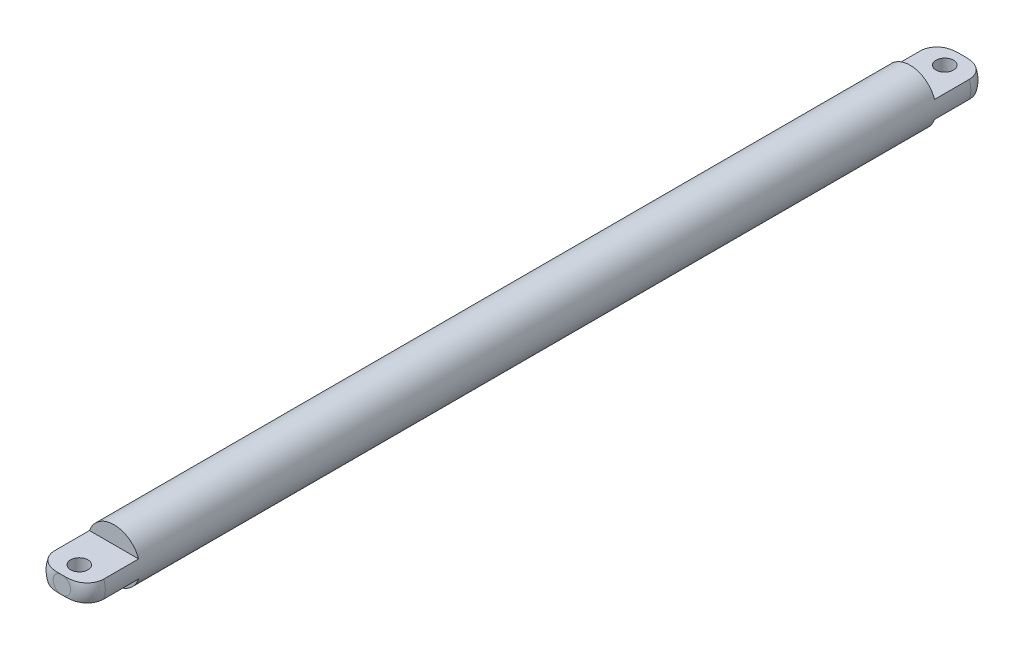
ISO-10303-21;
HEADER;
FILE_DESCRIPTION(('STEP AP214'),'2;1');
FILE_NAME('part.step','',(''),(''),'','','');
FILE_SCHEMA(('AUTOMOTIVE_DESIGN { 1 0 10303 214 1 1 1 1 }'));
ENDSEC;
DATA;
#1=APPLICATION_CONTEXT('core data for automotive mechanical design processes');
#2=APPLICATION_PROTOCOL_DEFINITION('international standard','automotive_design',2000,#1);
#3=PRODUCT_CONTEXT('',#1,'mechanical');
#4=PRODUCT('Part','Part','',(#3));
#5=PRODUCT_RELATED_PRODUCT_CATEGORY('part','',(#4));
#6=PRODUCT_DEFINITION_FORMATION('','',#4);
#7=PRODUCT_DEFINITION_CONTEXT('part definition',#1,'design');
#8=PRODUCT_DEFINITION('design','',#6,#7);
#9=PRODUCT_DEFINITION_SHAPE('','',#8);
#10=(LENGTH_UNIT() NAMED_UNIT(*) SI_UNIT(.MILLI.,.METRE.));
#11=(NAMED_UNIT(*) PLANE_ANGLE_UNIT() SI_UNIT($,.RADIAN.));
#12=(NAMED_UNIT(*) SI_UNIT($,.STERADIAN.) SOLID_ANGLE_UNIT());
#13=UNCERTAINTY_MEASURE_WITH_UNIT(LENGTH_MEASURE(1.E-05),#10,'distance_accuracy_value','');
#14=(GEOMETRIC_REPRESENTATION_CONTEXT(3) GLOBAL_UNCERTAINTY_ASSIGNED_CONTEXT((#13)) GLOBAL_UNIT_ASSIGNED_CONTEXT((#10,
#11,#12)) REPRESENTATION_CONTEXT('',''));
#15=CARTESIAN_POINT('',(0.,0.,0.));
#16=DIRECTION('',(0.,0.,1.));
#17=DIRECTION('',(1.,0.,0.));
#18=AXIS2_PLACEMENT_3D('',#15,#16,#17);
#19=CARTESIAN_POINT('',(0.,0.,-1036.));
#20=DIRECTION('',(0.,0.,1.));
#21=DIRECTION('',(1.,0.,0.));
#22=AXIS2_PLACEMENT_3D('',#19,#20,#21);
#23=CYLINDRICAL_SURFACE('',#22,30.);
#24=DIRECTION('',(0.,0.,1.));
#25=VECTOR('',#24,1.);
#26=CARTESIAN_POINT('',(-28.2842712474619,9.99999999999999,-1036.));
#27=LINE('',#26,#25);
#28=CARTESIAN_POINT('',(-28.2842712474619,9.99999999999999,-1016.));
#29=VERTEX_POINT('',#28);
#30=CARTESIAN_POINT('',(-28.2842712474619,9.99999999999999,-976.));
#31=VERTEX_POINT('',#30);
#32=EDGE_CURVE('E156',#29,#31,#27,.T.);
#33=ORIENTED_EDGE('',*,*,#32,.F.);
#34=CARTESIAN_POINT('',(0.,0.,-1016.));
#35=DIRECTION('',(0.,0.,1.));
#36=DIRECTION('',(1.,0.,0.));
#37=AXIS2_PLACEMENT_3D('',#34,#35,#36);
#38=CIRCLE('',#37,30.);
#39=CARTESIAN_POINT('',(-28.2842712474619,-9.99999999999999,-1016.));
#40=VERTEX_POINT('',#39);
#41=EDGE_CURVE('E284',#29,#40,#38,.T.);
#42=ORIENTED_EDGE('',*,*,#41,.T.);
#43=DIRECTION('',(0.,0.,1.));
#44=VECTOR('',#43,1.);
#45=CARTESIAN_POINT('',(-28.2842712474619,-9.99999999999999,-1036.));
#46=LINE('',#45,#44);
#47=CARTESIAN_POINT('',(-28.2842712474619,-9.99999999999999,-976.));
#48=VERTEX_POINT('',#47);
#49=EDGE_CURVE('E148',#40,#48,#46,.T.);
#50=ORIENTED_EDGE('',*,*,#49,.T.);
#51=CARTESIAN_POINT('',(0.,0.,-976.));
#52=DIRECTION('',(0.,0.,1.));
#53=DIRECTION('',(1.,0.,0.));
#54=AXIS2_PLACEMENT_3D('',#51,#52,#53);
#55=CIRCLE('',#54,30.);
#56=CARTESIAN_POINT('',(28.2842712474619,-9.99999999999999,-976.));
#57=VERTEX_POINT('',#56);
#58=EDGE_CURVE('E163',#57,#48,#55,.F.);
#59=ORIENTED_EDGE('',*,*,#58,.F.);
#60=DIRECTION('',(0.,0.,1.));
#61=VECTOR('',#60,1.);
#62=CARTESIAN_POINT('',(28.2842712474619,-9.99999999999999,-1036.));
#63=LINE('',#62,#61);
#64=CARTESIAN_POINT('',(28.2842712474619,-9.99999999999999,-1016.));
#65=VERTEX_POINT('',#64);
#66=EDGE_CURVE('E150',#57,#65,#63,.F.);
#67=ORIENTED_EDGE('',*,*,#66,.T.);
#68=CARTESIAN_POINT('',(0.,0.,-1016.));
#69=DIRECTION('',(0.,0.,1.));
#70=DIRECTION('',(1.,0.,0.));
#71=AXIS2_PLACEMENT_3D('',#68,#69,#70);
#72=CIRCLE('',#71,30.);
#73=CARTESIAN_POINT('',(28.2842712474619,9.99999999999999,-1016.));
#74=VERTEX_POINT('',#73);
#75=EDGE_CURVE('E223',#65,#74,#72,.T.);
#76=ORIENTED_EDGE('',*,*,#75,.T.);
#77=DIRECTION('',(0.,0.,1.));
#78=VECTOR('',#77,1.);
#79=CARTESIAN_POINT('',(28.2842712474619,9.99999999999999,-1036.));
#80=LINE('',#79,#78);
#81=CARTESIAN_POINT('',(28.2842712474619,9.99999999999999,-976.));
#82=VERTEX_POINT('',#81);
#83=EDGE_CURVE('E158',#82,#74,#80,.F.);
#84=ORIENTED_EDGE('',*,*,#83,.F.);
#85=CARTESIAN_POINT('',(0.,0.,-976.));
#86=DIRECTION('',(0.,0.,-1.));
#87=DIRECTION('',(-1.,0.,0.));
#88=AXIS2_PLACEMENT_3D('',#85,#86,#87);
#89=CIRCLE('',#88,30.);
#90=EDGE_CURVE('E160',#82,#31,#89,.F.);
#91=ORIENTED_EDGE('',*,*,#90,.T.);
#92=EDGE_LOOP('',(#33,#42,#50,#59,#67,#76,#84,#91));
#93=FACE_BOUND('',#92,.T.);
#94=DIRECTION('',(0.,0.,1.));
#95=VECTOR('',#94,1.);
#96=CARTESIAN_POINT('',(-28.284271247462,-9.99999999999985,-1036.));
#97=LINE('',#96,#95);
#98=CARTESIAN_POINT('',(-28.284271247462,-9.99999999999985,-20.));
#99=VERTEX_POINT('',#98);
#100=CARTESIAN_POINT('',(-28.284271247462,-9.99999999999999,-60.0000000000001));
#101=VERTEX_POINT('',#100);
#102=EDGE_CURVE('E128',#99,#101,#97,.F.);
#103=ORIENTED_EDGE('',*,*,#102,.F.);
#104=CARTESIAN_POINT('',(0.,0.,-20.));
#105=DIRECTION('',(0.,0.,1.));
#106=DIRECTION('',(1.,0.,0.));
#107=AXIS2_PLACEMENT_3D('',#104,#105,#106);
#108=CIRCLE('',#107,30.);
#109=CARTESIAN_POINT('',(-28.284271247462,9.99999999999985,-20.));
#110=VERTEX_POINT('',#109);
#111=EDGE_CURVE('E329',#99,#110,#108,.F.);
#112=ORIENTED_EDGE('',*,*,#111,.T.);
#113=DIRECTION('',(0.,0.,1.));
#114=VECTOR('',#113,1.);
#115=CARTESIAN_POINT('',(-28.284271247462,9.99999999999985,-1036.));
#116=LINE('',#115,#114);
#117=CARTESIAN_POINT('',(-28.2842712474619,9.99999999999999,-60.0000000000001));
#118=VERTEX_POINT('',#117);
#119=EDGE_CURVE('E143',#110,#118,#116,.F.);
#120=ORIENTED_EDGE('',*,*,#119,.T.);
#121=CARTESIAN_POINT('',(0.,0.,-60.0000000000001));
#122=DIRECTION('',(0.,0.,-1.));
#123=DIRECTION('',(-1.,0.,0.));
#124=AXIS2_PLACEMENT_3D('',#121,#122,#123);
#125=CIRCLE('',#124,30.);
#126=CARTESIAN_POINT('',(28.2842712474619,9.99999999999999,-60.0000000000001));
#127=VERTEX_POINT('',#126);
#128=EDGE_CURVE('E120',#127,#118,#125,.F.);
#129=ORIENTED_EDGE('',*,*,#128,.F.);
#130=DIRECTION('',(0.,0.,1.));
#131=VECTOR('',#130,1.);
#132=CARTESIAN_POINT('',(28.284271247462,9.99999999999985,-1036.));
#133=LINE('',#132,#131);
#134=CARTESIAN_POINT('',(28.284271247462,9.99999999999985,-20.));
#135=VERTEX_POINT('',#134);
#136=EDGE_CURVE('E141',#127,#135,#133,.T.);
#137=ORIENTED_EDGE('',*,*,#136,.T.);
#138=CARTESIAN_POINT('',(0.,0.,-20.));
#139=DIRECTION('',(0.,0.,1.));
#140=DIRECTION('',(1.,0.,0.));
#141=AXIS2_PLACEMENT_3D('',#138,#139,#140);
#142=CIRCLE('',#141,30.);
#143=CARTESIAN_POINT('',(28.284271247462,-9.99999999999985,-20.));
#144=VERTEX_POINT('',#143);
#145=EDGE_CURVE('E133',#135,#144,#142,.F.);
#146=ORIENTED_EDGE('',*,*,#145,.T.);
#147=DIRECTION('',(0.,0.,1.));
#148=VECTOR('',#147,1.);
#149=CARTESIAN_POINT('',(28.284271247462,-9.99999999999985,-1036.));
#150=LINE('',#149,#148);
#151=CARTESIAN_POINT('',(28.284271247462,-9.99999999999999,-60.0000000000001));
#152=VERTEX_POINT('',#151);
#153=EDGE_CURVE('E126',#152,#144,#150,.T.);
#154=ORIENTED_EDGE('',*,*,#153,.F.);
#155=CARTESIAN_POINT('',(0.,0.,-60.0000000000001));
#156=DIRECTION('',(0.,0.,1.));
#157=DIRECTION('',(1.,0.,0.));
#158=AXIS2_PLACEMENT_3D('',#155,#156,#157);
#159=CIRCLE('',#158,30.);
#160=EDGE_CURVE('E112',#152,#101,#159,.F.);
#161=ORIENTED_EDGE('',*,*,#160,.T.);
#162=EDGE_LOOP('',(#103,#112,#120,#129,#137,#146,#154,#161));
#163=FACE_BOUND('',#162,.T.);
#164=ADVANCED_FACE('F32',(#93,#163),#23,.T.);
#165=CARTESIAN_POINT('',(0.,0.,0.));
#166=DIRECTION('',(0.,0.,1.));
#167=DIRECTION('',(1.,0.,0.));
#168=AXIS2_PLACEMENT_3D('',#165,#166,#167);
#169=PLANE('',#168);
#170=CARTESIAN_POINT('',(0.,0.,0.));
#171=DIRECTION('',(0.,0.,1.));
#172=DIRECTION('',(1.,0.,0.));
#173=AXIS2_PLACEMENT_3D('',#170,#171,#172);
#174=CIRCLE('',#173,10.);
#175=CARTESIAN_POINT('',(0.,-9.99999999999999,0.));
#176=VERTEX_POINT('',#175);
#177=CARTESIAN_POINT('',(0.,9.99999999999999,0.));
#178=VERTEX_POINT('',#177);
#179=EDGE_CURVE('E119',#176,#178,#174,.T.);
#180=ORIENTED_EDGE('',*,*,#179,.T.);
#181=CARTESIAN_POINT('',(0.,0.,0.));
#182=DIRECTION('',(0.,0.,1.));
#183=DIRECTION('',(1.,0.,0.));
#184=AXIS2_PLACEMENT_3D('',#181,#182,#183);
#185=CIRCLE('',#184,10.);
#186=EDGE_CURVE('E170',#178,#176,#185,.T.);
#187=ORIENTED_EDGE('',*,*,#186,.T.);
#188=EDGE_LOOP('',(#180,#187));
#189=FACE_BOUND('',#188,.T.);
#190=ADVANCED_FACE('F234',(#189),#169,.T.);
#191=CARTESIAN_POINT('',(0.,0.,-1036.));
#192=DIRECTION('',(0.,0.,1.));
#193=DIRECTION('',(1.,0.,0.));
#194=AXIS2_PLACEMENT_3D('',#191,#192,#193);
#195=PLANE('',#194);
#196=CARTESIAN_POINT('',(0.,0.,-1036.));
#197=DIRECTION('',(0.,0.,1.));
#198=DIRECTION('',(1.,0.,0.));
#199=AXIS2_PLACEMENT_3D('',#196,#197,#198);
#200=CIRCLE('',#199,10.);
#201=CARTESIAN_POINT('',(0.,9.99999999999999,-1036.));
#202=VERTEX_POINT('',#201);
#203=CARTESIAN_POINT('',(0.,-9.99999999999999,-1036.));
#204=VERTEX_POINT('',#203);
#205=EDGE_CURVE('E56',#202,#204,#200,.F.);
#206=ORIENTED_EDGE('',*,*,#205,.T.);
#207=CARTESIAN_POINT('',(0.,0.,-1036.));
#208=DIRECTION('',(0.,0.,1.));
#209=DIRECTION('',(1.,0.,0.));
#210=AXIS2_PLACEMENT_3D('',#207,#208,#209);
#211=CIRCLE('',#210,10.);
#212=EDGE_CURVE('E256',#204,#202,#211,.F.);
#213=ORIENTED_EDGE('',*,*,#212,.T.);
#214=EDGE_LOOP('',(#206,#213));
#215=FACE_BOUND('',#214,.T.);
#216=ADVANCED_FACE('F238',(#215),#195,.F.);
#217=CARTESIAN_POINT('',(50.,0.,-976.));
#218=DIRECTION('',(0.,0.,-1.));
#219=DIRECTION('',(-1.,0.,0.));
#220=AXIS2_PLACEMENT_3D('',#217,#218,#219);
#221=PLANE('',#220);
#222=DIRECTION('',(-1.,0.,0.));
#223=VECTOR('',#222,1.);
#224=CARTESIAN_POINT('',(50.,9.99999999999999,-976.));
#225=LINE('',#224,#223);
#226=EDGE_CURVE('E153',#82,#31,#225,.T.);
#227=ORIENTED_EDGE('',*,*,#226,.T.);
#228=ORIENTED_EDGE('',*,*,#90,.F.);
#229=EDGE_LOOP('',(#227,#228));
#230=FACE_BOUND('',#229,.T.);
#231=ADVANCED_FACE('F242',(#230),#221,.T.);
#232=CARTESIAN_POINT('',(50.,9.99999999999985,0.));
#233=DIRECTION('',(0.,-1.,0.));
#234=DIRECTION('',(0.,0.,-1.));
#235=AXIS2_PLACEMENT_3D('',#232,#233,#234);
#236=PLANE('',#235);
#237=CARTESIAN_POINT('',(0.,9.99999999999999,-1016.));
#238=DIRECTION('',(0.,1.,0.));
#239=DIRECTION('',(0.,0.,1.));
#240=AXIS2_PLACEMENT_3D('',#237,#238,#239);
#241=CIRCLE('',#240,10.);
#242=CARTESIAN_POINT('',(0.,9.99999999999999,-1006.));
#243=VERTEX_POINT('',#242);
#244=EDGE_CURVE('E306',#243,#243,#241,.T.);
#245=ORIENTED_EDGE('',*,*,#244,.F.);
#246=EDGE_LOOP('',(#245));
#247=FACE_BOUND('',#246,.T.);
#248=CARTESIAN_POINT('',(28.2842712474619,9.99999999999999,-1016.));
#249=CARTESIAN_POINT('',(28.2842718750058,9.99999999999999,-1016.26700488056));
#250=CARTESIAN_POINT('',(28.2785993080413,9.99999999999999,-1016.53397957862));
#251=CARTESIAN_POINT('',(28.255926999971,9.99999999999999,-1017.06744081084));
#252=CARTESIAN_POINT('',(28.2389275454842,9.99999999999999,-1017.33392735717));
#253=CARTESIAN_POINT('',(28.170980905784,9.99999999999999,-1018.1318729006));
#254=CARTESIAN_POINT('',(28.1030854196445,9.99999999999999,-1018.66197937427));
#255=CARTESIAN_POINT('',(27.922800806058,9.99999999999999,-1019.71345979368));
#256=CARTESIAN_POINT('',(27.8105022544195,9.99999999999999,-1020.2348492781));
#257=CARTESIAN_POINT('',(27.6094183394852,9.99999999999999,-1021.00828780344));
#258=CARTESIAN_POINT('',(27.5369469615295,9.99999999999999,-1021.26467121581));
#259=CARTESIAN_POINT('',(27.3812452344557,9.99999999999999,-1021.77421994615));
#260=CARTESIAN_POINT('',(27.2980122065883,9.99999999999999,-1022.02738444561));
#261=CARTESIAN_POINT('',(27.0324150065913,9.99999999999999,-1022.78131952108));
#262=CARTESIAN_POINT('',(26.8341406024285,9.99999999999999,-1023.27657822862));
#263=CARTESIAN_POINT('',(26.39677415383,9.99999999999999,-1024.24873232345));
#264=CARTESIAN_POINT('',(26.1576814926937,9.99999999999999,-1024.72562743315));
#265=CARTESIAN_POINT('',(25.7698299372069,9.99999999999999,-1025.42484444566));
#266=CARTESIAN_POINT('',(25.6356085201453,9.99999999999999,-1025.65533197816));
#267=CARTESIAN_POINT('',(25.3577298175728,9.99999999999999,-1026.11046479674));
#268=CARTESIAN_POINT('',(25.2140750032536,9.99999999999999,-1026.33511159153));
#269=CARTESIAN_POINT('',(24.7692972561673,10.,-1026.99985346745));
#270=CARTESIAN_POINT('',(24.4543383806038,9.99999999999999,-1027.43079081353));
#271=CARTESIAN_POINT('',(23.7865680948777,9.99999999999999,-1028.2697000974));
#272=CARTESIAN_POINT('',(23.4333931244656,9.99999999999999,-1028.67738253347));
#273=CARTESIAN_POINT('',(22.879510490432,9.99999999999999,-1029.2660061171));
#274=CARTESIAN_POINT('',(22.6908508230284,9.99999999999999,-1029.4584082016));
#275=CARTESIAN_POINT('',(22.305787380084,9.99999999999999,-1029.83538650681));
#276=CARTESIAN_POINT('',(22.1093819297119,9.99999999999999,-1030.01996101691));
#277=CARTESIAN_POINT('',(21.5099321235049,9.99999999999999,-1030.56079562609));
#278=CARTESIAN_POINT('',(21.0958874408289,9.99999999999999,-1030.90498059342));
#279=CARTESIAN_POINT('',(20.2416834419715,9.99999999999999,-1031.55925830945));
#280=CARTESIAN_POINT('',(19.8015225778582,9.99999999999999,-1031.86934903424));
#281=CARTESIAN_POINT('',(19.1159837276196,9.99999999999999,-1032.31330456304));
#282=CARTESIAN_POINT('',(18.8788956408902,9.99999999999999,-1032.46011400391));
#283=CARTESIAN_POINT('',(18.3991048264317,9.99999999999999,-1032.74411107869));
#284=CARTESIAN_POINT('',(18.1564034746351,9.99999999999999,-1032.88130103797));
#285=CARTESIAN_POINT('',(17.4203319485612,9.99999999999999,-1033.27844129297));
#286=CARTESIAN_POINT('',(16.9190630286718,9.99999999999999,-1033.52391757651));
#287=CARTESIAN_POINT('',(15.8965773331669,9.99999999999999,-1033.97727199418));
#288=CARTESIAN_POINT('',(15.3752650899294,9.99999999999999,-1034.18493334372));
#289=CARTESIAN_POINT('',(14.3192543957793,9.99999999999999,-1034.56156386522));
#290=CARTESIAN_POINT('',(13.7845645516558,9.99999999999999,-1034.73055723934));
#291=CARTESIAN_POINT('',(12.7054710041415,9.99999999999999,-1035.03140671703));
#292=CARTESIAN_POINT('',(12.1610772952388,9.99999999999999,-1035.16329892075));
#293=CARTESIAN_POINT('',(11.0650204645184,9.99999999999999,-1035.39273021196));
#294=CARTESIAN_POINT('',(10.513355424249,9.99999999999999,-1035.49026003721));
#295=CARTESIAN_POINT('',(9.40347530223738,9.99999999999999,-1035.65486449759));
#296=CARTESIAN_POINT('',(8.84524343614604,9.99999999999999,-1035.72182381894));
#297=CARTESIAN_POINT('',(7.72638292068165,9.99999999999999,-1035.82963879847));
#298=CARTESIAN_POINT('',(7.16575440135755,9.99999999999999,-1035.87049585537));
#299=CARTESIAN_POINT('',(6.05248255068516,9.99999999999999,-1035.93167085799));
#300=CARTESIAN_POINT('',(5.49985548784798,9.99999999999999,-1035.9523079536));
#301=CARTESIAN_POINT('',(4.39425645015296,9.99999999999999,-1035.98073095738));
#302=CARTESIAN_POINT('',(3.84128444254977,9.99999999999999,-1035.98851536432));
#303=CARTESIAN_POINT('',(3.01422520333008,9.99999999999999,-1035.99531483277));
#304=CARTESIAN_POINT('',(2.74014831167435,9.99999999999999,-1035.9967726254));
#305=CARTESIAN_POINT('',(2.19199042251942,9.99999999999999,-1035.99873949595));
#306=CARTESIAN_POINT('',(1.9179094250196,9.99999999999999,-1035.99924857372));
#307=CARTESIAN_POINT('',(1.36985607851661,9.99999999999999,-1035.99985070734));
#308=CARTESIAN_POINT('',(1.09588372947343,9.99999999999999,-1035.99994392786));
#309=CARTESIAN_POINT('',(0.547940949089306,9.99999999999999,-1035.99999921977));
#310=CARTESIAN_POINT('',(0.273970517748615,9.99999999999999,-1035.99996129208));
#311=CARTESIAN_POINT('',(0.,9.99999999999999,-1036.));
#312=B_SPLINE_CURVE_WITH_KNOTS('',3,(#248,#249,#250,#251,#252,#253,#254,#255,#256,#257,#258,
#259,#260,#261,#262,#263,#264,#265,#266,#267,#268,#269,#270,#271,#272,#273,#274,#275,#276,#277,
#278,#279,#280,#281,#282,#283,#284,#285,#286,#287,#288,#289,#290,#291,#292,#293,#294,#295,#296,
#297,#298,#299,#300,#301,#302,#303,#304,#305,#306,#307,#308,#309,#310,#311),.UNSPECIFIED.,.F.,
.F.,(4,2,2,2,2,2,2,2,2,2,2,2,2,2,2,2,2,2,2,2,2,2,2,2,2,2,2,2,2,2,2,4),(0.,0.800894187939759,
1.60176811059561,3.20303283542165,4.80104792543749,5.6001285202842,6.39940840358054,
7.99782432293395,9.59626439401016,10.3962242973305,11.1959754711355,12.7953383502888,
14.4115371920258,15.2197340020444,16.0281065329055,17.6415071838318,19.2550035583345,
20.091390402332,20.9275743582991,22.6001870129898,24.2821056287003,25.9629686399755,
27.6421904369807,29.3218645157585,31.0078231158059,32.6936913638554,34.3524994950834,
36.0115013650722,36.8337441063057,37.6559869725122,38.4779041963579,39.2998155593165),.UNSPECIFIED.);
#313=EDGE_CURVE('E45',#74,#202,#312,.T.);
#314=ORIENTED_EDGE('',*,*,#313,.T.);
#315=CARTESIAN_POINT('',(0.,10.,-1036.));
#316=CARTESIAN_POINT('',(-0.206523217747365,10.,-1035.99998728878));
#317=CARTESIAN_POINT('',(-0.413046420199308,9.99999999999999,-1035.99999970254));
#318=CARTESIAN_POINT('',(-0.826093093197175,9.99999999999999,-1035.99998191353));
#319=CARTESIAN_POINT('',(-1.03261656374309,9.99999999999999,-1035.9999517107));
#320=CARTESIAN_POINT('',(-1.44568058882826,9.99999999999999,-1035.99975581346));
#321=CARTESIAN_POINT('',(-1.65222114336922,9.99999999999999,-1035.99959010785));
#322=CARTESIAN_POINT('',(-2.06530166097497,9.99999999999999,-1035.99894297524));
#323=CARTESIAN_POINT('',(-2.27184162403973,9.99999999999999,-1035.99846154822));
#324=CARTESIAN_POINT('',(-2.89267803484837,9.99999999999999,-1035.99620721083));
#325=CARTESIAN_POINT('',(-3.30697304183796,9.99999999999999,-1035.99362232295));
#326=CARTESIAN_POINT('',(-4.13551254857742,9.99999999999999,-1035.98393030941));
#327=CARTESIAN_POINT('',(-4.54975704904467,9.99999999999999,-1035.97682325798));
#328=CARTESIAN_POINT('',(-5.38526440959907,9.99999999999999,-1035.95515898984));
#329=CARTESIAN_POINT('',(-5.80652426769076,9.99999999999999,-1035.9404745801));
#330=CARTESIAN_POINT('',(-6.64857761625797,9.99999999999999,-1035.90068432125));
#331=CARTESIAN_POINT('',(-7.0693711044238,9.99999999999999,-1035.87557842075));
#332=CARTESIAN_POINT('',(-7.90952797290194,9.99999999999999,-1035.81228355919));
#333=CARTESIAN_POINT('',(-8.32889242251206,9.99999999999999,-1035.77410916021));
#334=CARTESIAN_POINT('',(-9.16593893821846,9.99999999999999,-1035.68231395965));
#335=CARTESIAN_POINT('',(-9.58362109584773,9.99999999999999,-1035.6286940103));
#336=CARTESIAN_POINT('',(-10.3268090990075,9.99999999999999,-1035.51744730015));
#337=CARTESIAN_POINT('',(-10.6528153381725,9.99999999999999,-1035.4631637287));
#338=CARTESIAN_POINT('',(-11.3027204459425,9.99999999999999,-1035.3430795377));
#339=CARTESIAN_POINT('',(-11.6266192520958,9.99999999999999,-1035.27727857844));
#340=CARTESIAN_POINT('',(-12.2717961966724,9.99999999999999,-1035.1334858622));
#341=CARTESIAN_POINT('',(-12.5930736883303,9.99999999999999,-1035.05549118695));
#342=CARTESIAN_POINT('',(-13.2322837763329,9.99999999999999,-1034.88681207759));
#343=CARTESIAN_POINT('',(-13.5502161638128,9.99999999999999,-1034.7961268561));
#344=CARTESIAN_POINT('',(-14.4942643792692,9.99999999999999,-1034.50553818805));
#345=CARTESIAN_POINT('',(-15.1145672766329,9.99999999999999,-1034.28623812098));
#346=CARTESIAN_POINT('',(-16.3334669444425,9.99999999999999,-1033.79396988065));
#347=CARTESIAN_POINT('',(-16.9320651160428,9.99999999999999,-1033.52100517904));
#348=CARTESIAN_POINT('',(-18.1081383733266,9.99999999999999,-1032.91781286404));
#349=CARTESIAN_POINT('',(-18.6853083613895,9.99999999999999,-1032.58698791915));
#350=CARTESIAN_POINT('',(-19.8052239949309,9.99999999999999,-1031.87127867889));
#351=CARTESIAN_POINT('',(-20.34796707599,9.99999999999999,-1031.48639036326));
#352=CARTESIAN_POINT('',(-21.3938129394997,9.99999999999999,-1030.66416848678));
#353=CARTESIAN_POINT('',(-21.896841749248,9.99999999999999,-1030.22674071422));
#354=CARTESIAN_POINT('',(-22.8562444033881,9.99999999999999,-1029.30345424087));
#355=CARTESIAN_POINT('',(-23.3126258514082,9.99999999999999,-1028.81760345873));
#356=CARTESIAN_POINT('',(-24.1124740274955,9.99999999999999,-1027.87369870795));
#357=CARTESIAN_POINT('',(-24.4627828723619,9.99999999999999,-1027.42142259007));
#358=CARTESIAN_POINT('',(-25.1219463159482,9.99999999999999,-1026.48763218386));
#359=CARTESIAN_POINT('',(-25.4308052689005,9.99999999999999,-1026.00612097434));
#360=CARTESIAN_POINT('',(-26.0039954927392,9.99999999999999,-1025.01800227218));
#361=CARTESIAN_POINT('',(-26.2683758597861,9.99999999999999,-1024.51142326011));
#362=CARTESIAN_POINT('',(-26.7506464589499,9.99999999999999,-1023.47659184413));
#363=CARTESIAN_POINT('',(-26.9685375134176,9.99999999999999,-1022.94833982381));
#364=CARTESIAN_POINT('',(-27.3469233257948,9.99999999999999,-1021.89912206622));
#365=CARTESIAN_POINT('',(-27.5096003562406,9.99999999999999,-1021.37894237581));
#366=CARTESIAN_POINT('',(-27.7895071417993,9.99999999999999,-1020.32653113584));
#367=CARTESIAN_POINT('',(-27.9067390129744,9.99999999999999,-1019.79430014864));
#368=CARTESIAN_POINT('',(-28.0949972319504,9.99999999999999,-1018.72044788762));
#369=CARTESIAN_POINT('',(-28.1659216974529,9.99999999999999,-1018.17880858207));
#370=CARTESIAN_POINT('',(-28.2369016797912,9.99999999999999,-1017.36337534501));
#371=CARTESIAN_POINT('',(-28.2546605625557,9.99999999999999,-1017.09101671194));
#372=CARTESIAN_POINT('',(-28.278345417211,9.99999999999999,-1016.54578375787));
#373=CARTESIAN_POINT('',(-28.2842713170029,9.99999999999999,-1016.27290943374));
#374=CARTESIAN_POINT('',(-28.2842712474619,9.99999999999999,-1016.));
#375=B_SPLINE_CURVE_WITH_KNOTS('',3,(#315,#316,#317,#318,#319,#320,#321,#322,#323,#324,#325,
#326,#327,#328,#329,#330,#331,#332,#333,#334,#335,#336,#337,#338,#339,#340,#341,#342,#343,#344,
#345,#346,#347,#348,#349,#350,#351,#352,#353,#354,#355,#356,#357,#358,#359,#360,#361,#362,#363,
#364,#365,#366,#367,#368,#369,#370,#371,#372,#373,#374),.UNSPECIFIED.,.F.,.F.,(4,2,2,2,2,2,2,2,
2,2,2,2,2,2,2,2,2,2,2,2,2,2,2,2,2,2,2,2,2,4),(0.,0.619569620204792,1.23914005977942,
1.85876168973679,2.47838335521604,3.72128055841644,4.96415736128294,6.22861050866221,
7.49306989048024,8.75612486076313,10.0191101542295,11.0104069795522,12.0017330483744,
12.9932967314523,13.9849219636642,15.9561191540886,17.92718886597,19.9199583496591,
21.9128760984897,23.9094223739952,25.9056426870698,27.6197023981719,29.3335819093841,
31.0455570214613,32.7575018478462,34.3905550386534,36.0235321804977,37.6600900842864,
38.4786790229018,39.2972729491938),.UNSPECIFIED.);
#376=EDGE_CURVE('E11',#202,#29,#375,.T.);
#377=ORIENTED_EDGE('',*,*,#376,.T.);
#378=ORIENTED_EDGE('',*,*,#32,.T.);
#379=ORIENTED_EDGE('',*,*,#226,.F.);
#380=ORIENTED_EDGE('',*,*,#83,.T.);
#381=EDGE_LOOP('',(#314,#377,#378,#379,#380));
#382=FACE_BOUND('',#381,.T.);
#383=ADVANCED_FACE('F244',(#247,#382),#236,.F.);
#384=CARTESIAN_POINT('',(50.,-9.99999999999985,0.));
#385=DIRECTION('',(0.,-1.,0.));
#386=DIRECTION('',(0.,0.,-1.));
#387=AXIS2_PLACEMENT_3D('',#384,#385,#386);
#388=PLANE('',#387);
#389=CARTESIAN_POINT('',(0.,-9.99999999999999,-1016.));
#390=DIRECTION('',(0.,-1.,0.));
#391=DIRECTION('',(0.,0.,-1.));
#392=AXIS2_PLACEMENT_3D('',#389,#390,#391);
#393=CIRCLE('',#392,10.);
#394=CARTESIAN_POINT('',(0.,-9.99999999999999,-1026.));
#395=VERTEX_POINT('',#394);
#396=EDGE_CURVE('E304',#395,#395,#393,.F.);
#397=ORIENTED_EDGE('',*,*,#396,.T.);
#398=EDGE_LOOP('',(#397));
#399=FACE_BOUND('',#398,.T.);
#400=ORIENTED_EDGE('',*,*,#49,.F.);
#401=CARTESIAN_POINT('',(-28.2842712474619,-9.99999999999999,-1016.));
#402=CARTESIAN_POINT('',(-28.2842718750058,-9.99999999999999,-1016.26700488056));
#403=CARTESIAN_POINT('',(-28.2785993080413,-9.99999999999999,-1016.53397957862));
#404=CARTESIAN_POINT('',(-28.255926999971,-9.99999999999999,-1017.06744081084));
#405=CARTESIAN_POINT('',(-28.2389275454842,-9.99999999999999,-1017.33392735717));
#406=CARTESIAN_POINT('',(-28.170980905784,-9.99999999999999,-1018.1318729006));
#407=CARTESIAN_POINT('',(-28.1030854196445,-9.99999999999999,-1018.66197937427));
#408=CARTESIAN_POINT('',(-27.922800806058,-9.99999999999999,-1019.71345979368));
#409=CARTESIAN_POINT('',(-27.8105022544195,-9.99999999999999,-1020.2348492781));
#410=CARTESIAN_POINT('',(-27.6094183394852,-9.99999999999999,-1021.00828780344));
#411=CARTESIAN_POINT('',(-27.5369469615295,-9.99999999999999,-1021.26467121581));
#412=CARTESIAN_POINT('',(-27.3812452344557,-9.99999999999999,-1021.77421994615));
#413=CARTESIAN_POINT('',(-27.2980122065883,-9.99999999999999,-1022.02738444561));
#414=CARTESIAN_POINT('',(-27.0324150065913,-9.99999999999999,-1022.78131952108));
#415=CARTESIAN_POINT('',(-26.8341406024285,-9.99999999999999,-1023.27657822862));
#416=CARTESIAN_POINT('',(-26.39677415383,-9.99999999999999,-1024.24873232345));
#417=CARTESIAN_POINT('',(-26.1576814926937,-9.99999999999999,-1024.72562743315));
#418=CARTESIAN_POINT('',(-25.7698299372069,-9.99999999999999,-1025.42484444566));
#419=CARTESIAN_POINT('',(-25.6356085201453,-9.99999999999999,-1025.65533197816));
#420=CARTESIAN_POINT('',(-25.3577298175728,-9.99999999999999,-1026.11046479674));
#421=CARTESIAN_POINT('',(-25.2140750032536,-9.99999999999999,-1026.33511159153));
#422=CARTESIAN_POINT('',(-24.7692972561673,-10.,-1026.99985346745));
#423=CARTESIAN_POINT('',(-24.4543383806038,-9.99999999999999,-1027.43079081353));
#424=CARTESIAN_POINT('',(-23.7865680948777,-9.99999999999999,-1028.2697000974));
#425=CARTESIAN_POINT('',(-23.4333931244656,-9.99999999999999,-1028.67738253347));
#426=CARTESIAN_POINT('',(-22.879510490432,-9.99999999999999,-1029.2660061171));
#427=CARTESIAN_POINT('',(-22.6908508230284,-9.99999999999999,-1029.4584082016));
#428=CARTESIAN_POINT('',(-22.305787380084,-9.99999999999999,-1029.83538650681));
#429=CARTESIAN_POINT('',(-22.1093819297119,-9.99999999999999,-1030.01996101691));
#430=CARTESIAN_POINT('',(-21.5099321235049,-9.99999999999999,-1030.56079562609));
#431=CARTESIAN_POINT('',(-21.0958874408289,-9.99999999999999,-1030.90498059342));
#432=CARTESIAN_POINT('',(-20.2416834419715,-9.99999999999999,-1031.55925830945));
#433=CARTESIAN_POINT('',(-19.8015225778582,-9.99999999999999,-1031.86934903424));
#434=CARTESIAN_POINT('',(-19.1159837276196,-9.99999999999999,-1032.31330456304));
#435=CARTESIAN_POINT('',(-18.8788956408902,-9.99999999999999,-1032.46011400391));
#436=CARTESIAN_POINT('',(-18.3991048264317,-9.99999999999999,-1032.74411107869));
#437=CARTESIAN_POINT('',(-18.1564034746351,-9.99999999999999,-1032.88130103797));
#438=CARTESIAN_POINT('',(-17.4203319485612,-9.99999999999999,-1033.27844129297));
#439=CARTESIAN_POINT('',(-16.9190630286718,-9.99999999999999,-1033.52391757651));
#440=CARTESIAN_POINT('',(-15.8965773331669,-9.99999999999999,-1033.97727199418));
#441=CARTESIAN_POINT('',(-15.3752650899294,-9.99999999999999,-1034.18493334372));
#442=CARTESIAN_POINT('',(-14.3192543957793,-9.99999999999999,-1034.56156386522));
#443=CARTESIAN_POINT('',(-13.7845645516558,-9.99999999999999,-1034.73055723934));
#444=CARTESIAN_POINT('',(-12.7054710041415,-9.99999999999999,-1035.03140671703));
#445=CARTESIAN_POINT('',(-12.1610772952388,-9.99999999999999,-1035.16329892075));
#446=CARTESIAN_POINT('',(-11.0650204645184,-9.99999999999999,-1035.39273021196));
#447=CARTESIAN_POINT('',(-10.513355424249,-9.99999999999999,-1035.49026003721));
#448=CARTESIAN_POINT('',(-9.40347530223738,-9.99999999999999,-1035.65486449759));
#449=CARTESIAN_POINT('',(-8.84524343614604,-9.99999999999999,-1035.72182381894));
#450=CARTESIAN_POINT('',(-7.72638292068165,-9.99999999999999,-1035.82963879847));
#451=CARTESIAN_POINT('',(-7.16575440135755,-9.99999999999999,-1035.87049585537));
#452=CARTESIAN_POINT('',(-6.05248255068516,-9.99999999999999,-1035.93167085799));
#453=CARTESIAN_POINT('',(-5.49985548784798,-9.99999999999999,-1035.9523079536));
#454=CARTESIAN_POINT('',(-4.39425645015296,-9.99999999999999,-1035.98073095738));
#455=CARTESIAN_POINT('',(-3.84128444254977,-9.99999999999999,-1035.98851536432));
#456=CARTESIAN_POINT('',(-3.01422520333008,-9.99999999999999,-1035.99531483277));
#457=CARTESIAN_POINT('',(-2.74014831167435,-9.99999999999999,-1035.9967726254));
#458=CARTESIAN_POINT('',(-2.19199042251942,-9.99999999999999,-1035.99873949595));
#459=CARTESIAN_POINT('',(-1.9179094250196,-9.99999999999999,-1035.99924857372));
#460=CARTESIAN_POINT('',(-1.36985607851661,-9.99999999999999,-1035.99985070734));
#461=CARTESIAN_POINT('',(-1.09588372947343,-9.99999999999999,-1035.99994392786));
#462=CARTESIAN_POINT('',(-0.547940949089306,-9.99999999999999,-1035.99999921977));
#463=CARTESIAN_POINT('',(-0.273970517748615,-9.99999999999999,-1035.99996129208));
#464=CARTESIAN_POINT('',(0.,-9.99999999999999,-1036.));
#465=B_SPLINE_CURVE_WITH_KNOTS('',3,(#401,#402,#403,#404,#405,#406,#407,#408,#409,#410,#411,
#412,#413,#414,#415,#416,#417,#418,#419,#420,#421,#422,#423,#424,#425,#426,#427,#428,#429,#430,
#431,#432,#433,#434,#435,#436,#437,#438,#439,#440,#441,#442,#443,#444,#445,#446,#447,#448,#449,
#450,#451,#452,#453,#454,#455,#456,#457,#458,#459,#460,#461,#462,#463,#464),.UNSPECIFIED.,.F.,
.F.,(4,2,2,2,2,2,2,2,2,2,2,2,2,2,2,2,2,2,2,2,2,2,2,2,2,2,2,2,2,2,2,4),(0.,0.800894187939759,
1.60176811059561,3.20303283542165,4.80104792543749,5.6001285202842,6.39940840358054,
7.99782432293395,9.59626439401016,10.3962242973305,11.1959754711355,12.7953383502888,
14.4115371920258,15.2197340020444,16.0281065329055,17.6415071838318,19.2550035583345,
20.091390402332,20.9275743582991,22.6001870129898,24.2821056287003,25.9629686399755,
27.6421904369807,29.3218645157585,31.0078231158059,32.6936913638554,34.3524994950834,
36.0115013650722,36.8337441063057,37.6559869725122,38.4779041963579,39.2998155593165),.UNSPECIFIED.);
#466=EDGE_CURVE('E259',#40,#204,#465,.T.);
#467=ORIENTED_EDGE('',*,*,#466,.T.);
#468=CARTESIAN_POINT('',(0.,-10.,-1036.));
#469=CARTESIAN_POINT('',(0.206523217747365,-10.,-1035.99998728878));
#470=CARTESIAN_POINT('',(0.413046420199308,-9.99999999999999,-1035.99999970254));
#471=CARTESIAN_POINT('',(0.826093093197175,-9.99999999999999,-1035.99998191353));
#472=CARTESIAN_POINT('',(1.03261656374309,-9.99999999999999,-1035.9999517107));
#473=CARTESIAN_POINT('',(1.44568058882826,-9.99999999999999,-1035.99975581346));
#474=CARTESIAN_POINT('',(1.65222114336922,-9.99999999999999,-1035.99959010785));
#475=CARTESIAN_POINT('',(2.06530166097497,-9.99999999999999,-1035.99894297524));
#476=CARTESIAN_POINT('',(2.27184162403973,-9.99999999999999,-1035.99846154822));
#477=CARTESIAN_POINT('',(2.89267803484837,-9.99999999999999,-1035.99620721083));
#478=CARTESIAN_POINT('',(3.30697304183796,-9.99999999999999,-1035.99362232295));
#479=CARTESIAN_POINT('',(4.13551254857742,-9.99999999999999,-1035.98393030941));
#480=CARTESIAN_POINT('',(4.54975704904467,-9.99999999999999,-1035.97682325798));
#481=CARTESIAN_POINT('',(5.38526440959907,-9.99999999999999,-1035.95515898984));
#482=CARTESIAN_POINT('',(5.80652426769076,-9.99999999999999,-1035.9404745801));
#483=CARTESIAN_POINT('',(6.64857761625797,-9.99999999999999,-1035.90068432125));
#484=CARTESIAN_POINT('',(7.0693711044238,-9.99999999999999,-1035.87557842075));
#485=CARTESIAN_POINT('',(7.90952797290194,-9.99999999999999,-1035.81228355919));
#486=CARTESIAN_POINT('',(8.32889242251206,-9.99999999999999,-1035.77410916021));
#487=CARTESIAN_POINT('',(9.16593893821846,-9.99999999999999,-1035.68231395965));
#488=CARTESIAN_POINT('',(9.58362109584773,-9.99999999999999,-1035.6286940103));
#489=CARTESIAN_POINT('',(10.3268090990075,-9.99999999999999,-1035.51744730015));
#490=CARTESIAN_POINT('',(10.6528153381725,-9.99999999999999,-1035.4631637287));
#491=CARTESIAN_POINT('',(11.3027204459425,-9.99999999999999,-1035.3430795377));
#492=CARTESIAN_POINT('',(11.6266192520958,-9.99999999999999,-1035.27727857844));
#493=CARTESIAN_POINT('',(12.2717961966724,-9.99999999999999,-1035.1334858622));
#494=CARTESIAN_POINT('',(12.5930736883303,-9.99999999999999,-1035.05549118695));
#495=CARTESIAN_POINT('',(13.2322837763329,-9.99999999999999,-1034.88681207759));
#496=CARTESIAN_POINT('',(13.5502161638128,-9.99999999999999,-1034.7961268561));
#497=CARTESIAN_POINT('',(14.4942643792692,-9.99999999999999,-1034.50553818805));
#498=CARTESIAN_POINT('',(15.1145672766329,-9.99999999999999,-1034.28623812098));
#499=CARTESIAN_POINT('',(16.3334669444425,-9.99999999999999,-1033.79396988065));
#500=CARTESIAN_POINT('',(16.9320651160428,-9.99999999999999,-1033.52100517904));
#501=CARTESIAN_POINT('',(18.1081383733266,-9.99999999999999,-1032.91781286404));
#502=CARTESIAN_POINT('',(18.6853083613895,-9.99999999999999,-1032.58698791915));
#503=CARTESIAN_POINT('',(19.8052239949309,-9.99999999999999,-1031.87127867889));
#504=CARTESIAN_POINT('',(20.34796707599,-9.99999999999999,-1031.48639036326));
#505=CARTESIAN_POINT('',(21.3938129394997,-9.99999999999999,-1030.66416848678));
#506=CARTESIAN_POINT('',(21.896841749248,-9.99999999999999,-1030.22674071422));
#507=CARTESIAN_POINT('',(22.8562444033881,-9.99999999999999,-1029.30345424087));
#508=CARTESIAN_POINT('',(23.3126258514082,-9.99999999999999,-1028.81760345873));
#509=CARTESIAN_POINT('',(24.1124740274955,-9.99999999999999,-1027.87369870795));
#510=CARTESIAN_POINT('',(24.4627828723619,-9.99999999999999,-1027.42142259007));
#511=CARTESIAN_POINT('',(25.1219463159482,-9.99999999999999,-1026.48763218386));
#512=CARTESIAN_POINT('',(25.4308052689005,-9.99999999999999,-1026.00612097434));
#513=CARTESIAN_POINT('',(26.0039954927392,-9.99999999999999,-1025.01800227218));
#514=CARTESIAN_POINT('',(26.2683758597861,-9.99999999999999,-1024.51142326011));
#515=CARTESIAN_POINT('',(26.7506464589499,-9.99999999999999,-1023.47659184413));
#516=CARTESIAN_POINT('',(26.9685375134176,-9.99999999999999,-1022.94833982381));
#517=CARTESIAN_POINT('',(27.3469233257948,-9.99999999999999,-1021.89912206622));
#518=CARTESIAN_POINT('',(27.5096003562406,-9.99999999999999,-1021.37894237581));
#519=CARTESIAN_POINT('',(27.7895071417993,-9.99999999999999,-1020.32653113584));
#520=CARTESIAN_POINT('',(27.9067390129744,-9.99999999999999,-1019.79430014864));
#521=CARTESIAN_POINT('',(28.0949972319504,-9.99999999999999,-1018.72044788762));
#522=CARTESIAN_POINT('',(28.1659216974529,-9.99999999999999,-1018.17880858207));
#523=CARTESIAN_POINT('',(28.2369016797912,-9.99999999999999,-1017.36337534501));
#524=CARTESIAN_POINT('',(28.2546605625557,-9.99999999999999,-1017.09101671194));
#525=CARTESIAN_POINT('',(28.278345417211,-9.99999999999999,-1016.54578375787));
#526=CARTESIAN_POINT('',(28.2842713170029,-9.99999999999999,-1016.27290943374));
#527=CARTESIAN_POINT('',(28.2842712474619,-9.99999999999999,-1016.));
#528=B_SPLINE_CURVE_WITH_KNOTS('',3,(#468,#469,#470,#471,#472,#473,#474,#475,#476,#477,#478,
#479,#480,#481,#482,#483,#484,#485,#486,#487,#488,#489,#490,#491,#492,#493,#494,#495,#496,#497,
#498,#499,#500,#501,#502,#503,#504,#505,#506,#507,#508,#509,#510,#511,#512,#513,#514,#515,#516,
#517,#518,#519,#520,#521,#522,#523,#524,#525,#526,#527),.UNSPECIFIED.,.F.,.F.,(4,2,2,2,2,2,2,2,
2,2,2,2,2,2,2,2,2,2,2,2,2,2,2,2,2,2,2,2,2,4),(0.,0.619569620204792,1.23914005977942,
1.85876168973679,2.47838335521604,3.72128055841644,4.96415736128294,6.22861050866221,
7.49306989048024,8.75612486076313,10.0191101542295,11.0104069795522,12.0017330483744,
12.9932967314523,13.9849219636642,15.9561191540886,17.92718886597,19.9199583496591,
21.9128760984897,23.9094223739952,25.9056426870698,27.6197023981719,29.3335819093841,
31.0455570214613,32.7575018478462,34.3905550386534,36.0235321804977,37.6600900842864,
38.4786790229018,39.2972729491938),.UNSPECIFIED.);
#529=EDGE_CURVE('E264',#204,#65,#528,.T.);
#530=ORIENTED_EDGE('',*,*,#529,.T.);
#531=ORIENTED_EDGE('',*,*,#66,.F.);
#532=DIRECTION('',(-1.,0.,0.));
#533=VECTOR('',#532,1.);
#534=CARTESIAN_POINT('',(50.,-9.99999999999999,-976.));
#535=LINE('',#534,#533);
#536=EDGE_CURVE('E145',#57,#48,#535,.T.);
#537=ORIENTED_EDGE('',*,*,#536,.T.);
#538=EDGE_LOOP('',(#400,#467,#530,#531,#537));
#539=FACE_BOUND('',#538,.T.);
#540=ADVANCED_FACE('F248',(#399,#539),#388,.T.);
#541=CARTESIAN_POINT('',(50.,0.,-976.));
#542=DIRECTION('',(0.,0.,1.));
#543=DIRECTION('',(1.,0.,0.));
#544=AXIS2_PLACEMENT_3D('',#541,#542,#543);
#545=PLANE('',#544);
#546=ORIENTED_EDGE('',*,*,#536,.F.);
#547=ORIENTED_EDGE('',*,*,#58,.T.);
#548=EDGE_LOOP('',(#546,#547));
#549=FACE_BOUND('',#548,.T.);
#550=ADVANCED_FACE('F206',(#549),#545,.F.);
#551=CARTESIAN_POINT('',(50.,9.99999999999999,0.));
#552=DIRECTION('',(0.,1.,0.));
#553=DIRECTION('',(0.,0.,1.));
#554=AXIS2_PLACEMENT_3D('',#551,#552,#553);
#555=PLANE('',#554);
#556=CARTESIAN_POINT('',(0.,9.99999999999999,-20.));
#557=DIRECTION('',(0.,1.,0.));
#558=DIRECTION('',(0.,0.,1.));
#559=AXIS2_PLACEMENT_3D('',#556,#557,#558);
#560=CIRCLE('',#559,10.);
#561=CARTESIAN_POINT('',(0.,9.99999999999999,-10.));
#562=VERTEX_POINT('',#561);
#563=EDGE_CURVE('E309',#562,#562,#560,.T.);
#564=ORIENTED_EDGE('',*,*,#563,.F.);
#565=EDGE_LOOP('',(#564));
#566=FACE_BOUND('',#565,.T.);
#567=ORIENTED_EDGE('',*,*,#119,.F.);
#568=CARTESIAN_POINT('',(-28.284271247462,9.99999999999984,-20.));
#569=CARTESIAN_POINT('',(-28.2842718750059,9.99999999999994,-19.7329951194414));
#570=CARTESIAN_POINT('',(-28.2785993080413,9.99999999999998,-19.4660204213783));
#571=CARTESIAN_POINT('',(-28.255926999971,10.,-18.9325591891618));
#572=CARTESIAN_POINT('',(-28.2389275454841,10.,-18.6660726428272));
#573=CARTESIAN_POINT('',(-28.170980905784,9.99999999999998,-17.8681270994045));
#574=CARTESIAN_POINT('',(-28.1030854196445,9.99999999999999,-17.3380206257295));
#575=CARTESIAN_POINT('',(-27.922800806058,10.,-16.286540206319));
#576=CARTESIAN_POINT('',(-27.8105022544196,9.99999999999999,-15.7651507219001));
#577=CARTESIAN_POINT('',(-27.6094183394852,9.99999999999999,-14.9917121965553));
#578=CARTESIAN_POINT('',(-27.5369469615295,9.99999999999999,-14.7353287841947));
#579=CARTESIAN_POINT('',(-27.3812452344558,9.99999999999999,-14.225780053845));
#580=CARTESIAN_POINT('',(-27.2980122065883,9.99999999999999,-13.9726155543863));
#581=CARTESIAN_POINT('',(-27.0324150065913,9.99999999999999,-13.2186804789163));
#582=CARTESIAN_POINT('',(-26.8341406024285,9.99999999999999,-12.7234217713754));
#583=CARTESIAN_POINT('',(-26.3967741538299,9.99999999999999,-11.7512676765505));
#584=CARTESIAN_POINT('',(-26.1576814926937,9.99999999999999,-11.2743725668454));
#585=CARTESIAN_POINT('',(-25.7698299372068,9.99999999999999,-10.5751555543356));
#586=CARTESIAN_POINT('',(-25.6356085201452,9.99999999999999,-10.3446680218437));
#587=CARTESIAN_POINT('',(-25.3577298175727,9.99999999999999,-9.8895352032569));
#588=CARTESIAN_POINT('',(-25.2140750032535,9.99999999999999,-9.66488840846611));
#589=CARTESIAN_POINT('',(-24.7692972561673,9.99999999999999,-9.00014653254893));
#590=CARTESIAN_POINT('',(-24.4543383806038,9.99999999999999,-8.56920918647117));
#591=CARTESIAN_POINT('',(-23.7865680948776,9.99999999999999,-7.73029990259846));
#592=CARTESIAN_POINT('',(-23.4333931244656,9.99999999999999,-7.32261746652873));
#593=CARTESIAN_POINT('',(-22.879510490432,9.99999999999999,-6.73399388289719));
#594=CARTESIAN_POINT('',(-22.6908508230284,9.99999999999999,-6.5415917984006));
#595=CARTESIAN_POINT('',(-22.305787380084,9.99999999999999,-6.16461349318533));
#596=CARTESIAN_POINT('',(-22.1093819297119,9.99999999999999,-5.98003898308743));
#597=CARTESIAN_POINT('',(-21.5099321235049,10.,-5.43920437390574));
#598=CARTESIAN_POINT('',(-21.0958874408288,9.99999999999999,-5.0950194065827));
#599=CARTESIAN_POINT('',(-20.2416834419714,9.99999999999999,-4.44074169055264));
#600=CARTESIAN_POINT('',(-19.801522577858,9.99999999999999,-4.13065096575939));
#601=CARTESIAN_POINT('',(-19.1159837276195,9.99999999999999,-3.68669543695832));
#602=CARTESIAN_POINT('',(-18.8788956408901,9.99999999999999,-3.53988599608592));
#603=CARTESIAN_POINT('',(-18.3991048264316,9.99999999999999,-3.25588892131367));
#604=CARTESIAN_POINT('',(-18.156403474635,9.99999999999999,-3.1186989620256));
#605=CARTESIAN_POINT('',(-17.420331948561,9.99999999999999,-2.72155870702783));
#606=CARTESIAN_POINT('',(-16.9190630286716,9.99999999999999,-2.47608242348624));
#607=CARTESIAN_POINT('',(-15.8965773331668,9.99999999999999,-2.02272800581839));
#608=CARTESIAN_POINT('',(-15.3752650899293,9.99999999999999,-1.81506665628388));
#609=CARTESIAN_POINT('',(-14.3192543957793,9.99999999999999,-1.43843613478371));
#610=CARTESIAN_POINT('',(-13.7845645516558,9.99999999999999,-1.26944276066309));
#611=CARTESIAN_POINT('',(-12.7054710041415,9.99999999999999,-0.968593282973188));
#612=CARTESIAN_POINT('',(-12.1610772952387,9.99999999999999,-0.836701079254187));
#613=CARTESIAN_POINT('',(-11.0650204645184,9.99999999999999,-0.607269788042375));
#614=CARTESIAN_POINT('',(-10.513355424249,9.99999999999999,-0.509739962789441));
#615=CARTESIAN_POINT('',(-9.40347530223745,9.99999999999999,-0.345135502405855));
#616=CARTESIAN_POINT('',(-8.84524343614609,9.99999999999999,-0.278176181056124));
#617=CARTESIAN_POINT('',(-7.72638292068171,9.99999999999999,-0.170361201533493));
#618=CARTESIAN_POINT('',(-7.16575440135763,9.99999999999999,-0.12950414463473));
#619=CARTESIAN_POINT('',(-6.05248255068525,9.99999999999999,-0.0683291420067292));
#620=CARTESIAN_POINT('',(-5.49985548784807,9.99999999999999,-0.0476920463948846));
#621=CARTESIAN_POINT('',(-4.39425645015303,9.99999999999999,-0.0192690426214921));
#622=CARTESIAN_POINT('',(-3.84128444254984,9.99999999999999,-0.0114846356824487));
#623=CARTESIAN_POINT('',(-3.01422520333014,9.99999999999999,-0.00468516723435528));
#624=CARTESIAN_POINT('',(-2.74014831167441,9.99999999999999,-0.00322737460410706));
#625=CARTESIAN_POINT('',(-2.19199042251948,9.99999999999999,-0.00126050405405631));
#626=CARTESIAN_POINT('',(-1.91790942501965,9.99999999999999,-0.000751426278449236));
#627=CARTESIAN_POINT('',(-1.36985607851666,9.99999999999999,-0.000149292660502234));
#628=CARTESIAN_POINT('',(-1.09588372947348,9.99999999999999,-5.60721360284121E-05));
#629=CARTESIAN_POINT('',(-0.547940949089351,9.99999999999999,-7.80231473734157E-07));
#630=CARTESIAN_POINT('',(-0.273970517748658,9.99999999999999,-3.87079162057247E-05));
#631=CARTESIAN_POINT('',(0.,9.99999999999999,0.));
#632=B_SPLINE_CURVE_WITH_KNOTS('',3,(#568,#569,#570,#571,#572,#573,#574,#575,#576,#577,#578,
#579,#580,#581,#582,#583,#584,#585,#586,#587,#588,#589,#590,#591,#592,#593,#594,#595,#596,#597,
#598,#599,#600,#601,#602,#603,#604,#605,#606,#607,#608,#609,#610,#611,#612,#613,#614,#615,#616,
#617,#618,#619,#620,#621,#622,#623,#624,#625,#626,#627,#628,#629,#630,#631),.UNSPECIFIED.,.F.,
.F.,(4,2,2,2,2,2,2,2,2,2,2,2,2,2,2,2,2,2,2,2,2,2,2,2,2,2,2,2,2,2,2,4),(0.,0.800894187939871,
1.60176811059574,3.20303283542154,4.80104792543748,5.60012852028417,6.39940840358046,
7.99782432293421,9.59626439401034,10.3962242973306,11.1959754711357,12.7953383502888,
14.4115371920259,15.2197340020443,16.0281065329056,17.6415071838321,19.2550035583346,
20.0913904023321,20.9275743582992,22.6001870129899,24.2821056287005,25.9629686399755,
27.6421904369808,29.3218645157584,31.0078231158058,32.6936913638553,34.3524994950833,
36.0115013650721,36.8337441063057,37.6559869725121,38.4779041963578,39.2998155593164),.UNSPECIFIED.);
#633=EDGE_CURVE('E217',#110,#178,#632,.T.);
#634=ORIENTED_EDGE('',*,*,#633,.T.);
#635=CARTESIAN_POINT('',(0.,10.,0.));
#636=CARTESIAN_POINT('',(0.206523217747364,10.,-1.27112249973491E-05));
#637=CARTESIAN_POINT('',(0.413046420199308,9.99999999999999,-2.97463429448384E-07));
#638=CARTESIAN_POINT('',(0.826093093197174,9.99999999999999,-1.80864722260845E-05));
#639=CARTESIAN_POINT('',(1.03261656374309,9.99999999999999,-4.8289298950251E-05));
#640=CARTESIAN_POINT('',(1.44568058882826,9.99999999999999,-0.000244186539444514));
#641=CARTESIAN_POINT('',(1.65222114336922,9.99999999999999,-0.000409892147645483));
#642=CARTESIAN_POINT('',(2.06530166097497,9.99999999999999,-0.0010570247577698));
#643=CARTESIAN_POINT('',(2.27184162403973,9.99999999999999,-0.00153845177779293));
#644=CARTESIAN_POINT('',(2.89267803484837,9.99999999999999,-0.00379278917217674));
#645=CARTESIAN_POINT('',(3.30697304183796,9.99999999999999,-0.00637767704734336));
#646=CARTESIAN_POINT('',(4.13551254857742,9.99999999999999,-0.0160696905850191));
#647=CARTESIAN_POINT('',(4.54975704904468,9.99999999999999,-0.023176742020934));
#648=CARTESIAN_POINT('',(5.38526440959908,9.99999999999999,-0.0448410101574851));
#649=CARTESIAN_POINT('',(5.80652426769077,9.99999999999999,-0.0595254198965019));
#650=CARTESIAN_POINT('',(6.64857761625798,9.99999999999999,-0.099315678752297));
#651=CARTESIAN_POINT('',(7.06937110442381,9.99999999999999,-0.124421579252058));
#652=CARTESIAN_POINT('',(7.90952797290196,9.99999999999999,-0.187716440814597));
#653=CARTESIAN_POINT('',(8.32889242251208,9.99999999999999,-0.225890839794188));
#654=CARTESIAN_POINT('',(9.16593893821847,9.99999999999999,-0.317686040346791));
#655=CARTESIAN_POINT('',(9.58362109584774,9.99999999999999,-0.371305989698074));
#656=CARTESIAN_POINT('',(10.3268090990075,9.99999999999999,-0.482552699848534));
#657=CARTESIAN_POINT('',(10.6528153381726,9.99999999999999,-0.536836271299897));
#658=CARTESIAN_POINT('',(11.3027204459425,9.99999999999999,-0.656920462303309));
#659=CARTESIAN_POINT('',(11.6266192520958,9.99999999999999,-0.722721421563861));
#660=CARTESIAN_POINT('',(12.2717961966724,9.99999999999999,-0.866514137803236));
#661=CARTESIAN_POINT('',(12.5930736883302,9.99999999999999,-0.944508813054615));
#662=CARTESIAN_POINT('',(13.2322837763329,9.99999999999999,-1.11318792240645));
#663=CARTESIAN_POINT('',(13.5502161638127,9.99999999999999,-1.20387314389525));
#664=CARTESIAN_POINT('',(14.4942643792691,9.99999999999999,-1.49446181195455));
#665=CARTESIAN_POINT('',(15.1145672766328,9.99999999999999,-1.71376187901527));
#666=CARTESIAN_POINT('',(16.3334669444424,9.99999999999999,-2.20603011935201));
#667=CARTESIAN_POINT('',(16.9320651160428,9.99999999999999,-2.47899482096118));
#668=CARTESIAN_POINT('',(18.1081383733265,9.99999999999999,-3.08218713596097));
#669=CARTESIAN_POINT('',(18.6853083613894,9.99999999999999,-3.41301208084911));
#670=CARTESIAN_POINT('',(19.8052239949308,9.99999999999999,-4.12872132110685));
#671=CARTESIAN_POINT('',(20.3479670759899,9.99999999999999,-4.51360963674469));
#672=CARTESIAN_POINT('',(21.3938129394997,9.99999999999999,-5.33583151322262));
#673=CARTESIAN_POINT('',(21.896841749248,9.99999999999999,-5.77325928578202));
#674=CARTESIAN_POINT('',(22.856244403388,9.99999999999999,-6.69654575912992));
#675=CARTESIAN_POINT('',(23.3126258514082,9.99999999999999,-7.18239654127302));
#676=CARTESIAN_POINT('',(24.1124740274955,9.99999999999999,-8.1263012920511));
#677=CARTESIAN_POINT('',(24.4627828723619,9.99999999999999,-8.57857740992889));
#678=CARTESIAN_POINT('',(25.1219463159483,9.99999999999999,-9.5123678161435));
#679=CARTESIAN_POINT('',(25.4308052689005,9.99999999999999,-9.99387902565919));
#680=CARTESIAN_POINT('',(26.0039954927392,9.99999999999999,-10.981997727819));
#681=CARTESIAN_POINT('',(26.2683758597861,9.99999999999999,-11.4885767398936));
#682=CARTESIAN_POINT('',(26.7506464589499,9.99999999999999,-12.5234081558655));
#683=CARTESIAN_POINT('',(26.9685375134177,9.99999999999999,-13.0516601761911));
#684=CARTESIAN_POINT('',(27.3469233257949,9.99999999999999,-14.1008779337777));
#685=CARTESIAN_POINT('',(27.5096003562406,9.99999999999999,-14.621057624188));
#686=CARTESIAN_POINT('',(27.7895071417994,9.99999999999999,-15.6734688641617));
#687=CARTESIAN_POINT('',(27.9067390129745,9.99999999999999,-16.2056998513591));
#688=CARTESIAN_POINT('',(28.0949972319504,9.99999999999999,-17.2795521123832));
#689=CARTESIAN_POINT('',(28.1659216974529,9.99999999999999,-17.8211914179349));
#690=CARTESIAN_POINT('',(28.2369016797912,9.99999999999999,-18.636624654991));
#691=CARTESIAN_POINT('',(28.2546605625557,9.99999999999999,-18.908983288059));
#692=CARTESIAN_POINT('',(28.278345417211,9.99999999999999,-19.4542162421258));
#693=CARTESIAN_POINT('',(28.2842713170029,9.99999999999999,-19.7270905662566));
#694=CARTESIAN_POINT('',(28.2842712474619,9.99999999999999,-20.));
#695=B_SPLINE_CURVE_WITH_KNOTS('',3,(#635,#636,#637,#638,#639,#640,#641,#642,#643,#644,#645,
#646,#647,#648,#649,#650,#651,#652,#653,#654,#655,#656,#657,#658,#659,#660,#661,#662,#663,#664,
#665,#666,#667,#668,#669,#670,#671,#672,#673,#674,#675,#676,#677,#678,#679,#680,#681,#682,#683,
#684,#685,#686,#687,#688,#689,#690,#691,#692,#693,#694),.UNSPECIFIED.,.F.,.F.,(4,2,2,2,2,2,2,2,
2,2,2,2,2,2,2,2,2,2,2,2,2,2,2,2,2,2,2,2,2,4),(0.,0.619569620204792,1.23914005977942,
1.85876168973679,2.47838335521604,3.72128055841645,4.96415736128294,6.22861050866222,
7.49306989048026,8.75612486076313,10.0191101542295,11.0104069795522,12.0017330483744,
12.9932967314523,13.9849219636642,15.9561191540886,17.92718886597,19.9199583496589,
21.9128760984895,23.9094223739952,25.9056426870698,27.619702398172,29.3335819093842,
31.0455570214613,32.7575018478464,34.3905550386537,36.0235321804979,37.6600900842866,
38.478679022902,39.297272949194),.UNSPECIFIED.);
#696=EDGE_CURVE('E211',#178,#135,#695,.T.);
#697=ORIENTED_EDGE('',*,*,#696,.T.);
#698=ORIENTED_EDGE('',*,*,#136,.F.);
#699=DIRECTION('',(-1.,0.,0.));
#700=VECTOR('',#699,1.);
#701=CARTESIAN_POINT('',(50.,9.99999999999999,-60.0000000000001));
#702=LINE('',#701,#700);
#703=EDGE_CURVE('E135',#127,#118,#702,.T.);
#704=ORIENTED_EDGE('',*,*,#703,.T.);
#705=EDGE_LOOP('',(#567,#634,#697,#698,#704));
#706=FACE_BOUND('',#705,.T.);
#707=ADVANCED_FACE('F201',(#566,#706),#555,.T.);
#708=CARTESIAN_POINT('',(50.,0.,-60.0000000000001));
#709=DIRECTION('',(0.,0.,-1.));
#710=DIRECTION('',(-1.,0.,0.));
#711=AXIS2_PLACEMENT_3D('',#708,#709,#710);
#712=PLANE('',#711);
#713=ORIENTED_EDGE('',*,*,#703,.F.);
#714=ORIENTED_EDGE('',*,*,#128,.T.);
#715=EDGE_LOOP('',(#713,#714));
#716=FACE_BOUND('',#715,.T.);
#717=ADVANCED_FACE('F198',(#716),#712,.F.);
#718=CARTESIAN_POINT('',(50.,0.,-60.0000000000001));
#719=DIRECTION('',(0.,0.,1.));
#720=DIRECTION('',(1.,0.,0.));
#721=AXIS2_PLACEMENT_3D('',#718,#719,#720);
#722=PLANE('',#721);
#723=DIRECTION('',(-1.,0.,0.));
#724=VECTOR('',#723,1.);
#725=CARTESIAN_POINT('',(50.,-9.99999999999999,-60.0000000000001));
#726=LINE('',#725,#724);
#727=EDGE_CURVE('E115',#152,#101,#726,.T.);
#728=ORIENTED_EDGE('',*,*,#727,.T.);
#729=ORIENTED_EDGE('',*,*,#160,.F.);
#730=EDGE_LOOP('',(#728,#729));
#731=FACE_BOUND('',#730,.T.);
#732=ADVANCED_FACE('F114',(#731),#722,.T.);
#733=CARTESIAN_POINT('',(50.,-9.99999999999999,0.));
#734=DIRECTION('',(0.,1.,0.));
#735=DIRECTION('',(0.,0.,1.));
#736=AXIS2_PLACEMENT_3D('',#733,#734,#735);
#737=PLANE('',#736);
#738=CARTESIAN_POINT('',(0.,-9.99999999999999,-20.));
#739=DIRECTION('',(0.,1.,0.));
#740=DIRECTION('',(0.,0.,1.));
#741=AXIS2_PLACEMENT_3D('',#738,#739,#740);
#742=CIRCLE('',#741,10.);
#743=CARTESIAN_POINT('',(0.,-9.99999999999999,-10.));
#744=VERTEX_POINT('',#743);
#745=EDGE_CURVE('E129',#744,#744,#742,.F.);
#746=ORIENTED_EDGE('',*,*,#745,.F.);
#747=EDGE_LOOP('',(#746));
#748=FACE_BOUND('',#747,.T.);
#749=CARTESIAN_POINT('',(28.284271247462,-9.99999999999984,-20.));
#750=CARTESIAN_POINT('',(28.2842718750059,-9.99999999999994,-19.7329951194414));
#751=CARTESIAN_POINT('',(28.2785993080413,-9.99999999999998,-19.4660204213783));
#752=CARTESIAN_POINT('',(28.255926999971,-10.,-18.9325591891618));
#753=CARTESIAN_POINT('',(28.2389275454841,-10.,-18.6660726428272));
#754=CARTESIAN_POINT('',(28.170980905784,-9.99999999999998,-17.8681270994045));
#755=CARTESIAN_POINT('',(28.1030854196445,-9.99999999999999,-17.3380206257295));
#756=CARTESIAN_POINT('',(27.922800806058,-10.,-16.286540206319));
#757=CARTESIAN_POINT('',(27.8105022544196,-9.99999999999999,-15.7651507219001));
#758=CARTESIAN_POINT('',(27.6094183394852,-9.99999999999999,-14.9917121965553));
#759=CARTESIAN_POINT('',(27.5369469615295,-9.99999999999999,-14.7353287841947));
#760=CARTESIAN_POINT('',(27.3812452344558,-9.99999999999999,-14.225780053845));
#761=CARTESIAN_POINT('',(27.2980122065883,-9.99999999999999,-13.9726155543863));
#762=CARTESIAN_POINT('',(27.0324150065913,-9.99999999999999,-13.2186804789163));
#763=CARTESIAN_POINT('',(26.8341406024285,-9.99999999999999,-12.7234217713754));
#764=CARTESIAN_POINT('',(26.3967741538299,-9.99999999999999,-11.7512676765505));
#765=CARTESIAN_POINT('',(26.1576814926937,-9.99999999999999,-11.2743725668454));
#766=CARTESIAN_POINT('',(25.7698299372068,-9.99999999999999,-10.5751555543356));
#767=CARTESIAN_POINT('',(25.6356085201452,-9.99999999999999,-10.3446680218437));
#768=CARTESIAN_POINT('',(25.3577298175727,-9.99999999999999,-9.8895352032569));
#769=CARTESIAN_POINT('',(25.2140750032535,-9.99999999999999,-9.66488840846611));
#770=CARTESIAN_POINT('',(24.7692972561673,-9.99999999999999,-9.00014653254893));
#771=CARTESIAN_POINT('',(24.4543383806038,-9.99999999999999,-8.56920918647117));
#772=CARTESIAN_POINT('',(23.7865680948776,-9.99999999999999,-7.73029990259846));
#773=CARTESIAN_POINT('',(23.4333931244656,-9.99999999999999,-7.32261746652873));
#774=CARTESIAN_POINT('',(22.879510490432,-9.99999999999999,-6.73399388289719));
#775=CARTESIAN_POINT('',(22.6908508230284,-9.99999999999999,-6.5415917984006));
#776=CARTESIAN_POINT('',(22.305787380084,-9.99999999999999,-6.16461349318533));
#777=CARTESIAN_POINT('',(22.1093819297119,-9.99999999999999,-5.98003898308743));
#778=CARTESIAN_POINT('',(21.5099321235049,-10.,-5.43920437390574));
#779=CARTESIAN_POINT('',(21.0958874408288,-9.99999999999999,-5.0950194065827));
#780=CARTESIAN_POINT('',(20.2416834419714,-9.99999999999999,-4.44074169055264));
#781=CARTESIAN_POINT('',(19.801522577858,-9.99999999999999,-4.13065096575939));
#782=CARTESIAN_POINT('',(19.1159837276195,-9.99999999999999,-3.68669543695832));
#783=CARTESIAN_POINT('',(18.8788956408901,-9.99999999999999,-3.53988599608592));
#784=CARTESIAN_POINT('',(18.3991048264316,-9.99999999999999,-3.25588892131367));
#785=CARTESIAN_POINT('',(18.156403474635,-9.99999999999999,-3.1186989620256));
#786=CARTESIAN_POINT('',(17.420331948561,-9.99999999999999,-2.72155870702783));
#787=CARTESIAN_POINT('',(16.9190630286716,-9.99999999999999,-2.47608242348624));
#788=CARTESIAN_POINT('',(15.8965773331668,-9.99999999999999,-2.02272800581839));
#789=CARTESIAN_POINT('',(15.3752650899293,-9.99999999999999,-1.81506665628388));
#790=CARTESIAN_POINT('',(14.3192543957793,-9.99999999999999,-1.43843613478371));
#791=CARTESIAN_POINT('',(13.7845645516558,-9.99999999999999,-1.26944276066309));
#792=CARTESIAN_POINT('',(12.7054710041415,-9.99999999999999,-0.968593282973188));
#793=CARTESIAN_POINT('',(12.1610772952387,-9.99999999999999,-0.836701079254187));
#794=CARTESIAN_POINT('',(11.0650204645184,-9.99999999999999,-0.607269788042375));
#795=CARTESIAN_POINT('',(10.513355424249,-9.99999999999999,-0.509739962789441));
#796=CARTESIAN_POINT('',(9.40347530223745,-9.99999999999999,-0.345135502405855));
#797=CARTESIAN_POINT('',(8.84524343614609,-9.99999999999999,-0.278176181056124));
#798=CARTESIAN_POINT('',(7.72638292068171,-9.99999999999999,-0.170361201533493));
#799=CARTESIAN_POINT('',(7.16575440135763,-9.99999999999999,-0.12950414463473));
#800=CARTESIAN_POINT('',(6.05248255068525,-9.99999999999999,-0.0683291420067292));
#801=CARTESIAN_POINT('',(5.49985548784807,-9.99999999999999,-0.0476920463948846));
#802=CARTESIAN_POINT('',(4.39425645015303,-9.99999999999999,-0.0192690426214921));
#803=CARTESIAN_POINT('',(3.84128444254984,-9.99999999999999,-0.0114846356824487));
#804=CARTESIAN_POINT('',(3.01422520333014,-9.99999999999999,-0.00468516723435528));
#805=CARTESIAN_POINT('',(2.74014831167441,-9.99999999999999,-0.00322737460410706));
#806=CARTESIAN_POINT('',(2.19199042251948,-9.99999999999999,-0.00126050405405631));
#807=CARTESIAN_POINT('',(1.91790942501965,-9.99999999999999,-0.000751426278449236));
#808=CARTESIAN_POINT('',(1.36985607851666,-9.99999999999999,-0.000149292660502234));
#809=CARTESIAN_POINT('',(1.09588372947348,-9.99999999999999,-5.60721360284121E-05));
#810=CARTESIAN_POINT('',(0.547940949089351,-9.99999999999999,-7.80231473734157E-07));
#811=CARTESIAN_POINT('',(0.273970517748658,-9.99999999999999,-3.87079162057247E-05));
#812=CARTESIAN_POINT('',(0.,-9.99999999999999,0.));
#813=B_SPLINE_CURVE_WITH_KNOTS('',3,(#749,#750,#751,#752,#753,#754,#755,#756,#757,#758,#759,
#760,#761,#762,#763,#764,#765,#766,#767,#768,#769,#770,#771,#772,#773,#774,#775,#776,#777,#778,
#779,#780,#781,#782,#783,#784,#785,#786,#787,#788,#789,#790,#791,#792,#793,#794,#795,#796,#797,
#798,#799,#800,#801,#802,#803,#804,#805,#806,#807,#808,#809,#810,#811,#812),.UNSPECIFIED.,.F.,
.F.,(4,2,2,2,2,2,2,2,2,2,2,2,2,2,2,2,2,2,2,2,2,2,2,2,2,2,2,2,2,2,2,4),(0.,0.800894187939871,
1.60176811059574,3.20303283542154,4.80104792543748,5.60012852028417,6.39940840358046,
7.99782432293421,9.59626439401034,10.3962242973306,11.1959754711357,12.7953383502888,
14.4115371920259,15.2197340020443,16.0281065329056,17.6415071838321,19.2550035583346,
20.0913904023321,20.9275743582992,22.6001870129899,24.2821056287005,25.9629686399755,
27.6421904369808,29.3218645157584,31.0078231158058,32.6936913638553,34.3524994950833,
36.0115013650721,36.8337441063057,37.6559869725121,38.4779041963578,39.2998155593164),.UNSPECIFIED.);
#814=EDGE_CURVE('E173',#144,#176,#813,.T.);
#815=ORIENTED_EDGE('',*,*,#814,.T.);
#816=CARTESIAN_POINT('',(0.,-10.,0.));
#817=CARTESIAN_POINT('',(-0.206523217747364,-10.,-1.27112249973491E-05));
#818=CARTESIAN_POINT('',(-0.413046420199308,-9.99999999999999,-2.97463429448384E-07));
#819=CARTESIAN_POINT('',(-0.826093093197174,-9.99999999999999,-1.80864722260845E-05));
#820=CARTESIAN_POINT('',(-1.03261656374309,-9.99999999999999,-4.8289298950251E-05));
#821=CARTESIAN_POINT('',(-1.44568058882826,-9.99999999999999,-0.000244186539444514));
#822=CARTESIAN_POINT('',(-1.65222114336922,-9.99999999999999,-0.000409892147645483));
#823=CARTESIAN_POINT('',(-2.06530166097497,-9.99999999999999,-0.0010570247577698));
#824=CARTESIAN_POINT('',(-2.27184162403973,-9.99999999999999,-0.00153845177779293));
#825=CARTESIAN_POINT('',(-2.89267803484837,-9.99999999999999,-0.00379278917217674));
#826=CARTESIAN_POINT('',(-3.30697304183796,-9.99999999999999,-0.00637767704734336));
#827=CARTESIAN_POINT('',(-4.13551254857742,-9.99999999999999,-0.0160696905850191));
#828=CARTESIAN_POINT('',(-4.54975704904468,-9.99999999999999,-0.023176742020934));
#829=CARTESIAN_POINT('',(-5.38526440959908,-9.99999999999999,-0.0448410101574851));
#830=CARTESIAN_POINT('',(-5.80652426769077,-9.99999999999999,-0.0595254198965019));
#831=CARTESIAN_POINT('',(-6.64857761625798,-9.99999999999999,-0.099315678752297));
#832=CARTESIAN_POINT('',(-7.06937110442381,-9.99999999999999,-0.124421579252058));
#833=CARTESIAN_POINT('',(-7.90952797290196,-9.99999999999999,-0.187716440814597));
#834=CARTESIAN_POINT('',(-8.32889242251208,-9.99999999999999,-0.225890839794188));
#835=CARTESIAN_POINT('',(-9.16593893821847,-9.99999999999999,-0.317686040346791));
#836=CARTESIAN_POINT('',(-9.58362109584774,-9.99999999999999,-0.371305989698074));
#837=CARTESIAN_POINT('',(-10.3268090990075,-9.99999999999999,-0.482552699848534));
#838=CARTESIAN_POINT('',(-10.6528153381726,-9.99999999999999,-0.536836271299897));
#839=CARTESIAN_POINT('',(-11.3027204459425,-9.99999999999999,-0.656920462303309));
#840=CARTESIAN_POINT('',(-11.6266192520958,-9.99999999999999,-0.722721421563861));
#841=CARTESIAN_POINT('',(-12.2717961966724,-9.99999999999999,-0.866514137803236));
#842=CARTESIAN_POINT('',(-12.5930736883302,-9.99999999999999,-0.944508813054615));
#843=CARTESIAN_POINT('',(-13.2322837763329,-9.99999999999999,-1.11318792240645));
#844=CARTESIAN_POINT('',(-13.5502161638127,-9.99999999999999,-1.20387314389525));
#845=CARTESIAN_POINT('',(-14.4942643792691,-9.99999999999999,-1.49446181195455));
#846=CARTESIAN_POINT('',(-15.1145672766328,-9.99999999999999,-1.71376187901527));
#847=CARTESIAN_POINT('',(-16.3334669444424,-9.99999999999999,-2.20603011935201));
#848=CARTESIAN_POINT('',(-16.9320651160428,-9.99999999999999,-2.47899482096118));
#849=CARTESIAN_POINT('',(-18.1081383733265,-9.99999999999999,-3.08218713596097));
#850=CARTESIAN_POINT('',(-18.6853083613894,-9.99999999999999,-3.41301208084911));
#851=CARTESIAN_POINT('',(-19.8052239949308,-9.99999999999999,-4.12872132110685));
#852=CARTESIAN_POINT('',(-20.3479670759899,-9.99999999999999,-4.51360963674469));
#853=CARTESIAN_POINT('',(-21.3938129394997,-9.99999999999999,-5.33583151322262));
#854=CARTESIAN_POINT('',(-21.896841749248,-9.99999999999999,-5.77325928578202));
#855=CARTESIAN_POINT('',(-22.856244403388,-9.99999999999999,-6.69654575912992));
#856=CARTESIAN_POINT('',(-23.3126258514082,-9.99999999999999,-7.18239654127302));
#857=CARTESIAN_POINT('',(-24.1124740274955,-9.99999999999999,-8.1263012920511));
#858=CARTESIAN_POINT('',(-24.4627828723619,-9.99999999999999,-8.57857740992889));
#859=CARTESIAN_POINT('',(-25.1219463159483,-9.99999999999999,-9.5123678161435));
#860=CARTESIAN_POINT('',(-25.4308052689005,-9.99999999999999,-9.99387902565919));
#861=CARTESIAN_POINT('',(-26.0039954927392,-9.99999999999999,-10.981997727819));
#862=CARTESIAN_POINT('',(-26.2683758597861,-9.99999999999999,-11.4885767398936));
#863=CARTESIAN_POINT('',(-26.7506464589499,-9.99999999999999,-12.5234081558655));
#864=CARTESIAN_POINT('',(-26.9685375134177,-9.99999999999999,-13.0516601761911));
#865=CARTESIAN_POINT('',(-27.3469233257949,-9.99999999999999,-14.1008779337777));
#866=CARTESIAN_POINT('',(-27.5096003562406,-9.99999999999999,-14.621057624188));
#867=CARTESIAN_POINT('',(-27.7895071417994,-9.99999999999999,-15.6734688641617));
#868=CARTESIAN_POINT('',(-27.9067390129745,-9.99999999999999,-16.2056998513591));
#869=CARTESIAN_POINT('',(-28.0949972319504,-9.99999999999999,-17.2795521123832));
#870=CARTESIAN_POINT('',(-28.1659216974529,-9.99999999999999,-17.8211914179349));
#871=CARTESIAN_POINT('',(-28.2369016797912,-9.99999999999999,-18.636624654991));
#872=CARTESIAN_POINT('',(-28.2546605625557,-9.99999999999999,-18.908983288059));
#873=CARTESIAN_POINT('',(-28.278345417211,-9.99999999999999,-19.4542162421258));
#874=CARTESIAN_POINT('',(-28.2842713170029,-9.99999999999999,-19.7270905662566));
#875=CARTESIAN_POINT('',(-28.2842712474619,-9.99999999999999,-20.));
#876=B_SPLINE_CURVE_WITH_KNOTS('',3,(#816,#817,#818,#819,#820,#821,#822,#823,#824,#825,#826,
#827,#828,#829,#830,#831,#832,#833,#834,#835,#836,#837,#838,#839,#840,#841,#842,#843,#844,#845,
#846,#847,#848,#849,#850,#851,#852,#853,#854,#855,#856,#857,#858,#859,#860,#861,#862,#863,#864,
#865,#866,#867,#868,#869,#870,#871,#872,#873,#874,#875),.UNSPECIFIED.,.F.,.F.,(4,2,2,2,2,2,2,2,
2,2,2,2,2,2,2,2,2,2,2,2,2,2,2,2,2,2,2,2,2,4),(0.,0.619569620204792,1.23914005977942,
1.85876168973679,2.47838335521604,3.72128055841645,4.96415736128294,6.22861050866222,
7.49306989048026,8.75612486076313,10.0191101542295,11.0104069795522,12.0017330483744,
12.9932967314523,13.9849219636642,15.9561191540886,17.92718886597,19.9199583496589,
21.9128760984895,23.9094223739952,25.9056426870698,27.619702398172,29.3335819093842,
31.0455570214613,32.7575018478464,34.3905550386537,36.0235321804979,37.6600900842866,
38.478679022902,39.297272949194),.UNSPECIFIED.);
#877=EDGE_CURVE('E180',#176,#99,#876,.T.);
#878=ORIENTED_EDGE('',*,*,#877,.T.);
#879=ORIENTED_EDGE('',*,*,#102,.T.);
#880=ORIENTED_EDGE('',*,*,#727,.F.);
#881=ORIENTED_EDGE('',*,*,#153,.T.);
#882=EDGE_LOOP('',(#815,#878,#879,#880,#881));
#883=FACE_BOUND('',#882,.T.);
#884=ADVANCED_FACE('F125',(#748,#883),#737,.F.);
#885=CARTESIAN_POINT('',(0.,-30.001,-20.));
#886=DIRECTION('',(0.,1.,0.));
#887=DIRECTION('',(0.,0.,1.));
#888=AXIS2_PLACEMENT_3D('',#885,#886,#887);
#889=CYLINDRICAL_SURFACE('',#888,10.);
#890=ORIENTED_EDGE('',*,*,#563,.T.);
#891=EDGE_LOOP('',(#890));
#892=FACE_BOUND('',#891,.T.);
#893=ORIENTED_EDGE('',*,*,#745,.T.);
#894=EDGE_LOOP('',(#893));
#895=FACE_BOUND('',#894,.T.);
#896=ADVANCED_FACE('F192',(#892,#895),#889,.F.);
#897=CARTESIAN_POINT('',(0.,-30.001,-1016.));
#898=DIRECTION('',(0.,1.,0.));
#899=DIRECTION('',(0.,0.,1.));
#900=AXIS2_PLACEMENT_3D('',#897,#898,#899);
#901=CYLINDRICAL_SURFACE('',#900,10.);
#902=ORIENTED_EDGE('',*,*,#396,.F.);
#903=EDGE_LOOP('',(#902));
#904=FACE_BOUND('',#903,.T.);
#905=ORIENTED_EDGE('',*,*,#244,.T.);
#906=EDGE_LOOP('',(#905));
#907=FACE_BOUND('',#906,.T.);
#908=ADVANCED_FACE('F229',(#904,#907),#901,.F.);
#909=CARTESIAN_POINT('',(0.,0.,-20.));
#910=DIRECTION('',(0.,0.,1.));
#911=DIRECTION('',(1.,0.,0.));
#912=AXIS2_PLACEMENT_3D('',#909,#910,#911);
#913=DEGENERATE_TOROIDAL_SURFACE('',#912,10.,20.,.T.);
#914=ORIENTED_EDGE('',*,*,#633,.F.);
#915=ORIENTED_EDGE('',*,*,#111,.F.);
#916=ORIENTED_EDGE('',*,*,#877,.F.);
#917=ORIENTED_EDGE('',*,*,#186,.F.);
#918=EDGE_LOOP('',(#914,#915,#916,#917));
#919=FACE_BOUND('',#918,.T.);
#920=ADVANCED_FACE('F225',(#919),#913,.T.);
#921=CARTESIAN_POINT('',(0.,0.,-20.));
#922=DIRECTION('',(0.,0.,1.));
#923=DIRECTION('',(1.,0.,0.));
#924=AXIS2_PLACEMENT_3D('',#921,#922,#923);
#925=DEGENERATE_TOROIDAL_SURFACE('',#924,10.,20.,.T.);
#926=ORIENTED_EDGE('',*,*,#814,.F.);
#927=ORIENTED_EDGE('',*,*,#145,.F.);
#928=ORIENTED_EDGE('',*,*,#696,.F.);
#929=ORIENTED_EDGE('',*,*,#179,.F.);
#930=EDGE_LOOP('',(#926,#927,#928,#929));
#931=FACE_BOUND('',#930,.T.);
#932=ADVANCED_FACE('F186',(#931),#925,.T.);
#933=CARTESIAN_POINT('',(0.,0.,-1016.));
#934=DIRECTION('',(0.,0.,1.));
#935=DIRECTION('',(1.,0.,0.));
#936=AXIS2_PLACEMENT_3D('',#933,#934,#935);
#937=DEGENERATE_TOROIDAL_SURFACE('',#936,10.,20.,.T.);
#938=ORIENTED_EDGE('',*,*,#376,.F.);
#939=ORIENTED_EDGE('',*,*,#212,.F.);
#940=ORIENTED_EDGE('',*,*,#466,.F.);
#941=ORIENTED_EDGE('',*,*,#41,.F.);
#942=EDGE_LOOP('',(#938,#939,#940,#941));
#943=FACE_BOUND('',#942,.T.);
#944=ADVANCED_FACE('F268',(#943),#937,.T.);
#945=CARTESIAN_POINT('',(0.,0.,-1016.));
#946=DIRECTION('',(0.,0.,1.));
#947=DIRECTION('',(1.,0.,0.));
#948=AXIS2_PLACEMENT_3D('',#945,#946,#947);
#949=DEGENERATE_TOROIDAL_SURFACE('',#948,10.,20.,.T.);
#950=ORIENTED_EDGE('',*,*,#529,.F.);
#951=ORIENTED_EDGE('',*,*,#205,.F.);
#952=ORIENTED_EDGE('',*,*,#313,.F.);
#953=ORIENTED_EDGE('',*,*,#75,.F.);
#954=EDGE_LOOP('',(#950,#951,#952,#953));
#955=FACE_BOUND('',#954,.T.);
#956=ADVANCED_FACE('F34',(#955),#949,.T.);
#957=CLOSED_SHELL('',(#164,#190,#216,#231,#383,#540,#550,#707,#717,#732,#884,#896,#908,#920,
#932,#944,#956));
#958=MANIFOLD_SOLID_BREP('B2',#957);
#959=ADVANCED_BREP_SHAPE_REPRESENTATION('',(#18,#958),#14);
#960=SHAPE_DEFINITION_REPRESENTATION(#9,#959);
ENDSEC;
END-ISO-10303-21;
